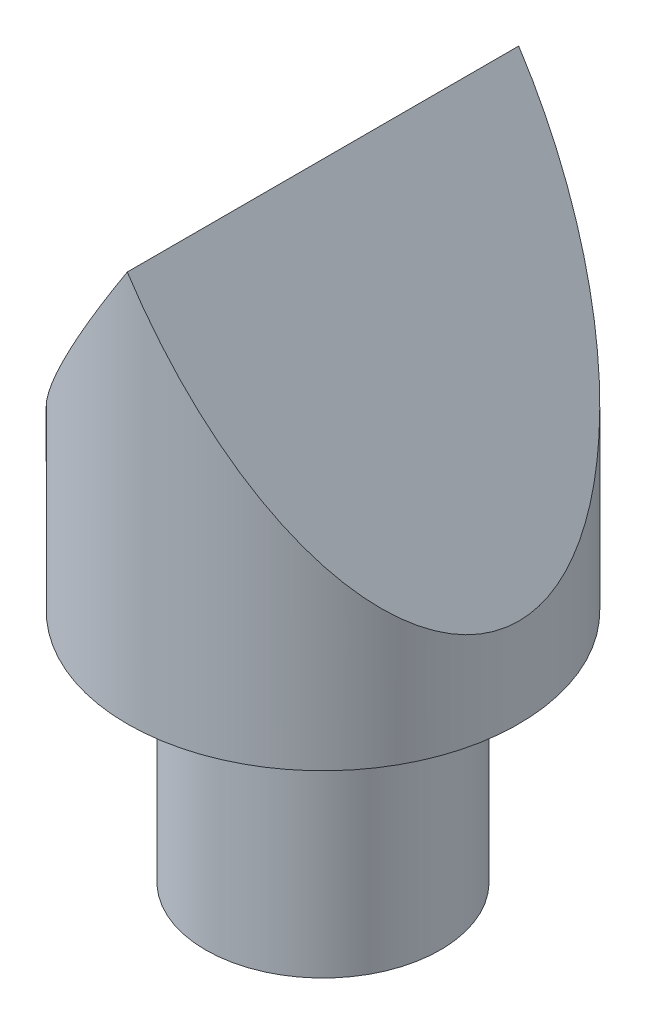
ISO-10303-21;
HEADER;
FILE_DESCRIPTION(('STEP AP214'),'2;1');
FILE_NAME('part.step','',(''),(''),'','','');
FILE_SCHEMA(('AUTOMOTIVE_DESIGN { 1 0 10303 214 1 1 1 1 }'));
ENDSEC;
DATA;
#1=APPLICATION_CONTEXT('core data for automotive mechanical design processes');
#2=APPLICATION_PROTOCOL_DEFINITION('international standard','automotive_design',2000,#1);
#3=PRODUCT_CONTEXT('',#1,'mechanical');
#4=PRODUCT('Part','Part','',(#3));
#5=PRODUCT_RELATED_PRODUCT_CATEGORY('part','',(#4));
#6=PRODUCT_DEFINITION_FORMATION('','',#4);
#7=PRODUCT_DEFINITION_CONTEXT('part definition',#1,'design');
#8=PRODUCT_DEFINITION('design','',#6,#7);
#9=PRODUCT_DEFINITION_SHAPE('','',#8);
#10=(LENGTH_UNIT() NAMED_UNIT(*) SI_UNIT(.MILLI.,.METRE.));
#11=(NAMED_UNIT(*) PLANE_ANGLE_UNIT() SI_UNIT($,.RADIAN.));
#12=(NAMED_UNIT(*) SI_UNIT($,.STERADIAN.) SOLID_ANGLE_UNIT());
#13=UNCERTAINTY_MEASURE_WITH_UNIT(LENGTH_MEASURE(1.E-05),#10,'distance_accuracy_value','');
#14=(GEOMETRIC_REPRESENTATION_CONTEXT(3) GLOBAL_UNCERTAINTY_ASSIGNED_CONTEXT((#13)) GLOBAL_UNIT_ASSIGNED_CONTEXT((#10,
#11,#12)) REPRESENTATION_CONTEXT('',''));
#15=CARTESIAN_POINT('',(0.,0.,0.));
#16=DIRECTION('',(0.,0.,1.));
#17=DIRECTION('',(1.,0.,0.));
#18=AXIS2_PLACEMENT_3D('',#15,#16,#17);
#19=CARTESIAN_POINT('',(0.,50.,0.));
#20=DIRECTION('',(0.,-1.,0.));
#21=DIRECTION('',(0.,0.,-1.));
#22=AXIS2_PLACEMENT_3D('',#19,#20,#21);
#23=CYLINDRICAL_SURFACE('',#22,25.);
#24=CARTESIAN_POINT('',(0.,50.,0.));
#25=DIRECTION('',(-0.839500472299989,-0.543358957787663,0.));
#26=DIRECTION('',(0.543358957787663,-0.839500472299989,0.));
#27=AXIS2_PLACEMENT_3D('',#24,#25,#26);
#28=ELLIPSE('',#27,46.0101000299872,25.);
#29=CARTESIAN_POINT('',(0.,50.,-25.));
#30=VERTEX_POINT('',#29);
#31=CARTESIAN_POINT('',(0.,50.,25.));
#32=VERTEX_POINT('',#31);
#33=EDGE_CURVE('E44',#30,#32,#28,.T.);
#34=ORIENTED_EDGE('',*,*,#33,.T.);
#35=CARTESIAN_POINT('',(0.,50.,0.));
#36=DIRECTION('',(0.839500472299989,-0.543358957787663,0.));
#37=DIRECTION('',(-0.543358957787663,-0.839500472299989,0.));
#38=AXIS2_PLACEMENT_3D('',#35,#36,#37);
#39=ELLIPSE('',#38,46.0101000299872,25.);
#40=EDGE_CURVE('E49',#32,#30,#39,.T.);
#41=ORIENTED_EDGE('',*,*,#40,.T.);
#42=EDGE_LOOP('',(#34,#41));
#43=FACE_BOUND('',#42,.T.);
#44=CARTESIAN_POINT('',(0.,0.,0.));
#45=DIRECTION('',(0.,1.,0.));
#46=DIRECTION('',(0.,0.,1.));
#47=AXIS2_PLACEMENT_3D('',#44,#45,#46);
#48=CIRCLE('',#47,25.);
#49=CARTESIAN_POINT('',(0.,0.,25.));
#50=VERTEX_POINT('',#49);
#51=EDGE_CURVE('E38',#50,#50,#48,.T.);
#52=ORIENTED_EDGE('',*,*,#51,.T.);
#53=EDGE_LOOP('',(#52));
#54=FACE_BOUND('',#53,.T.);
#55=ADVANCED_FACE('F31',(#43,#54),#23,.T.);
#56=CARTESIAN_POINT('',(0.,0.,0.));
#57=DIRECTION('',(0.,1.,0.));
#58=DIRECTION('',(0.,0.,1.));
#59=AXIS2_PLACEMENT_3D('',#56,#57,#58);
#60=PLANE('',#59);
#61=CARTESIAN_POINT('',(0.,0.,0.));
#62=DIRECTION('',(0.,1.,0.));
#63=DIRECTION('',(0.,0.,1.));
#64=AXIS2_PLACEMENT_3D('',#61,#62,#63);
#65=CIRCLE('',#64,15.);
#66=CARTESIAN_POINT('',(0.,0.,15.));
#67=VERTEX_POINT('',#66);
#68=EDGE_CURVE('E54',#67,#67,#65,.T.);
#69=ORIENTED_EDGE('',*,*,#68,.T.);
#70=EDGE_LOOP('',(#69));
#71=FACE_BOUND('',#70,.T.);
#72=ORIENTED_EDGE('',*,*,#51,.F.);
#73=EDGE_LOOP('',(#72));
#74=FACE_BOUND('',#73,.T.);
#75=ADVANCED_FACE('F64',(#71,#74),#60,.F.);
#76=CARTESIAN_POINT('',(0.,-30.,0.));
#77=DIRECTION('',(0.,1.,0.));
#78=DIRECTION('',(0.,0.,1.));
#79=AXIS2_PLACEMENT_3D('',#76,#77,#78);
#80=CYLINDRICAL_SURFACE('',#79,15.);
#81=CARTESIAN_POINT('',(0.,-30.,0.));
#82=DIRECTION('',(0.,1.,0.));
#83=DIRECTION('',(0.,0.,1.));
#84=AXIS2_PLACEMENT_3D('',#81,#82,#83);
#85=CIRCLE('',#84,15.);
#86=CARTESIAN_POINT('',(0.,-30.,15.));
#87=VERTEX_POINT('',#86);
#88=EDGE_CURVE('E57',#87,#87,#85,.T.);
#89=ORIENTED_EDGE('',*,*,#88,.T.);
#90=EDGE_LOOP('',(#89));
#91=FACE_BOUND('',#90,.T.);
#92=ORIENTED_EDGE('',*,*,#68,.F.);
#93=EDGE_LOOP('',(#92));
#94=FACE_BOUND('',#93,.T.);
#95=ADVANCED_FACE('F66',(#91,#94),#80,.T.);
#96=CARTESIAN_POINT('',(0.,-30.,0.));
#97=DIRECTION('',(0.,1.,0.));
#98=DIRECTION('',(0.,0.,1.));
#99=AXIS2_PLACEMENT_3D('',#96,#97,#98);
#100=PLANE('',#99);
#101=ORIENTED_EDGE('',*,*,#88,.F.);
#102=EDGE_LOOP('',(#101));
#103=FACE_BOUND('',#102,.T.);
#104=ADVANCED_FACE('F72',(#103),#100,.F.);
#105=CARTESIAN_POINT('',(0.,50.,-40.));
#106=DIRECTION('',(0.839500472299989,-0.543358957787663,0.));
#107=DIRECTION('',(0.543358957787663,0.839500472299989,0.));
#108=AXIS2_PLACEMENT_3D('',#105,#106,#107);
#109=PLANE('',#108);
#110=ORIENTED_EDGE('',*,*,#40,.F.);
#111=DIRECTION('',(0.,0.,-1.));
#112=VECTOR('',#111,1.);
#113=CARTESIAN_POINT('',(0.,50.,0.));
#114=LINE('',#113,#112);
#115=EDGE_CURVE('E11',#32,#30,#114,.T.);
#116=ORIENTED_EDGE('',*,*,#115,.T.);
#117=EDGE_LOOP('',(#110,#116));
#118=FACE_BOUND('',#117,.T.);
#119=ADVANCED_FACE('F53',(#118),#109,.F.);
#120=CARTESIAN_POINT('',(25.,11.374499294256,-40.));
#121=DIRECTION('',(-0.839500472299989,-0.543358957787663,0.));
#122=DIRECTION('',(0.543358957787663,-0.839500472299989,0.));
#123=AXIS2_PLACEMENT_3D('',#120,#121,#122);
#124=PLANE('',#123);
#125=ORIENTED_EDGE('',*,*,#33,.F.);
#126=ORIENTED_EDGE('',*,*,#115,.F.);
#127=EDGE_LOOP('',(#125,#126));
#128=FACE_BOUND('',#127,.T.);
#129=ADVANCED_FACE('F51',(#128),#124,.F.);
#130=CLOSED_SHELL('',(#55,#75,#95,#104,#119,#129));
#131=MANIFOLD_SOLID_BREP('B2',#130);
#132=ADVANCED_BREP_SHAPE_REPRESENTATION('',(#18,#131),#14);
#133=SHAPE_DEFINITION_REPRESENTATION(#9,#132);
ENDSEC;
END-ISO-10303-21;
